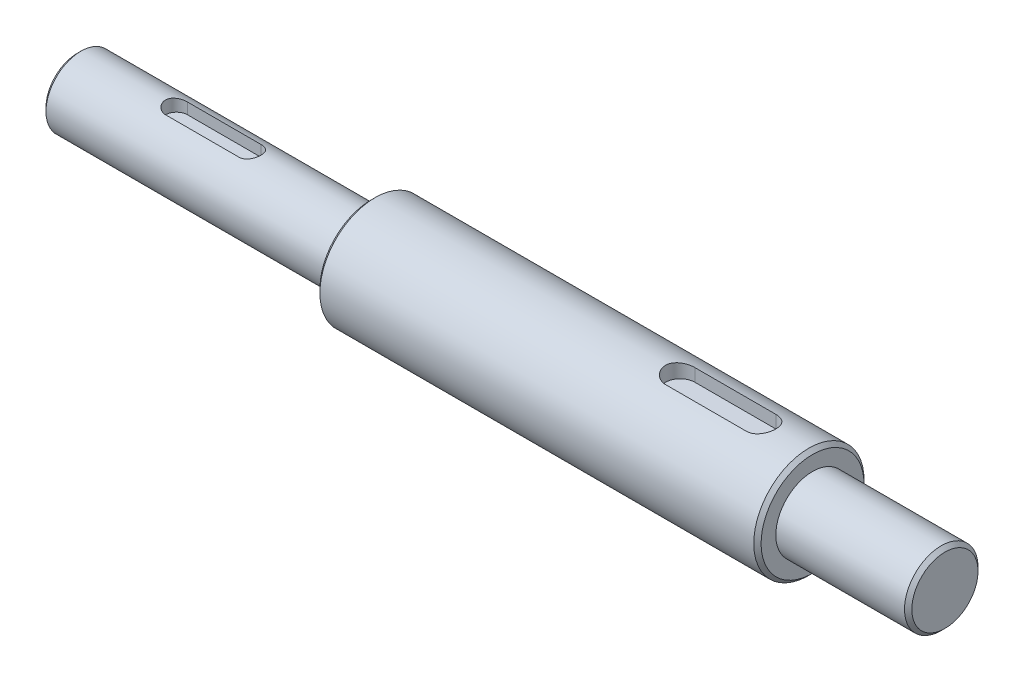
ISO-10303-21;
HEADER;
FILE_DESCRIPTION(('STEP AP214'),'2;1');
FILE_NAME('part.step','',(''),(''),'','','');
FILE_SCHEMA(('AUTOMOTIVE_DESIGN { 1 0 10303 214 1 1 1 1 }'));
ENDSEC;
DATA;
#1=APPLICATION_CONTEXT('core data for automotive mechanical design processes');
#2=APPLICATION_PROTOCOL_DEFINITION('international standard','automotive_design',2000,#1);
#3=PRODUCT_CONTEXT('',#1,'mechanical');
#4=PRODUCT('Part','Part','',(#3));
#5=PRODUCT_RELATED_PRODUCT_CATEGORY('part','',(#4));
#6=PRODUCT_DEFINITION_FORMATION('','',#4);
#7=PRODUCT_DEFINITION_CONTEXT('part definition',#1,'design');
#8=PRODUCT_DEFINITION('design','',#6,#7);
#9=PRODUCT_DEFINITION_SHAPE('','',#8);
#10=(LENGTH_UNIT() NAMED_UNIT(*) SI_UNIT(.MILLI.,.METRE.));
#11=(NAMED_UNIT(*) PLANE_ANGLE_UNIT() SI_UNIT($,.RADIAN.));
#12=(NAMED_UNIT(*) SI_UNIT($,.STERADIAN.) SOLID_ANGLE_UNIT());
#13=UNCERTAINTY_MEASURE_WITH_UNIT(LENGTH_MEASURE(1.E-05),#10,'distance_accuracy_value','');
#14=(GEOMETRIC_REPRESENTATION_CONTEXT(3) GLOBAL_UNCERTAINTY_ASSIGNED_CONTEXT((#13)) GLOBAL_UNIT_ASSIGNED_CONTEXT((#10,
#11,#12)) REPRESENTATION_CONTEXT('',''));
#15=CARTESIAN_POINT('',(0.,0.,0.));
#16=DIRECTION('',(0.,0.,1.));
#17=DIRECTION('',(1.,0.,0.));
#18=AXIS2_PLACEMENT_3D('',#15,#16,#17);
#19=CARTESIAN_POINT('',(236.,2.22044604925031E-13,-1.11022302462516E-13));
#20=DIRECTION('',(1.,0.,0.));
#21=DIRECTION('',(0.,1.00000000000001,0.));
#22=AXIS2_PLACEMENT_3D('',#19,#20,#21);
#23=CYLINDRICAL_SURFACE('',#22,15.);
#24=CARTESIAN_POINT('',(199.,2.22044604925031E-13,-1.11022302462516E-13));
#25=DIRECTION('',(1.,0.,0.));
#26=DIRECTION('',(0.,1.00000000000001,0.));
#27=AXIS2_PLACEMENT_3D('',#24,#25,#26);
#28=CIRCLE('',#27,15.);
#29=CARTESIAN_POINT('',(199.,15.0000000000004,-1.11854969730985E-13));
#30=VERTEX_POINT('',#29);
#31=EDGE_CURVE('E313',#30,#30,#28,.F.);
#32=ORIENTED_EDGE('',*,*,#31,.T.);
#33=EDGE_LOOP('',(#32));
#34=FACE_BOUND('',#33,.T.);
#35=CARTESIAN_POINT('',(81.,2.22044604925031E-13,-1.11022302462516E-13));
#36=DIRECTION('',(-1.,0.,0.));
#37=DIRECTION('',(0.,-1.00000000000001,0.));
#38=AXIS2_PLACEMENT_3D('',#35,#36,#37);
#39=CIRCLE('',#38,15.);
#40=CARTESIAN_POINT('',(81.,-14.9999999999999,-1.10189635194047E-13));
#41=VERTEX_POINT('',#40);
#42=EDGE_CURVE('E309',#41,#41,#39,.F.);
#43=ORIENTED_EDGE('',*,*,#42,.T.);
#44=EDGE_LOOP('',(#43));
#45=FACE_BOUND('',#44,.T.);
#46=CARTESIAN_POINT('',(164.000000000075,14.4568322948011,-4.00000000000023));
#47=CARTESIAN_POINT('',(163.889641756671,14.4568189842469,-4.00001309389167));
#48=CARTESIAN_POINT('',(163.779291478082,14.4580956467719,-3.99543311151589));
#49=CARTESIAN_POINT('',(163.559421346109,14.4631301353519,-3.97718874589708));
#50=CARTESIAN_POINT('',(163.449901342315,14.4668875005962,-3.96352604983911));
#51=CARTESIAN_POINT('',(163.232698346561,14.4767740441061,-3.92725695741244));
#52=CARTESIAN_POINT('',(163.125011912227,14.4828981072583,-3.90466984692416));
#53=CARTESIAN_POINT('',(162.912025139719,14.497323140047,-3.85076543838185));
#54=CARTESIAN_POINT('',(162.80672484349,14.5056241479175,-3.81944798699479));
#55=CARTESIAN_POINT('',(162.495536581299,14.5334412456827,-3.71275643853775));
#56=CARTESIAN_POINT('',(162.294125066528,14.5558829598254,-3.62460332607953));
#57=CARTESIAN_POINT('',(161.908979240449,14.6060171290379,-3.41695780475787));
#58=CARTESIAN_POINT('',(161.725250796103,14.6337113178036,-3.29745504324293));
#59=CARTESIAN_POINT('',(161.376029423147,14.6920016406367,-3.02730320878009));
#60=CARTESIAN_POINT('',(161.211038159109,14.7226489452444,-2.87601544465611));
#61=CARTESIAN_POINT('',(160.908442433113,14.782952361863,-2.54795832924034));
#62=CARTESIAN_POINT('',(160.770842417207,14.8126083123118,-2.37118484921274));
#63=CARTESIAN_POINT('',(160.524827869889,14.8681604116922,-1.99367199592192));
#64=CARTESIAN_POINT('',(160.416916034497,14.8939887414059,-1.79259414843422));
#65=CARTESIAN_POINT('',(160.236627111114,14.9383834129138,-1.37435575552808));
#66=CARTESIAN_POINT('',(160.164242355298,14.9569513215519,-1.15719869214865));
#67=CARTESIAN_POINT('',(160.058690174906,14.9843709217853,-0.718234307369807));
#68=CARTESIAN_POINT('',(160.024662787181,14.993435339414,-0.496647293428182));
#69=CARTESIAN_POINT('',(159.994085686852,15.0015705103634,-0.0507319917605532));
#70=CARTESIAN_POINT('',(159.997530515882,15.0006427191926,0.173595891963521));
#71=CARTESIAN_POINT('',(160.041195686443,14.9890534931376,0.612629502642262));
#72=CARTESIAN_POINT('',(160.080486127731,14.9786381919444,0.827435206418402));
#73=CARTESIAN_POINT('',(160.193225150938,14.9495347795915,1.24728467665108));
#74=CARTESIAN_POINT('',(160.266675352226,14.9308462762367,1.45232797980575));
#75=CARTESIAN_POINT('',(160.446359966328,14.8869312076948,1.84920963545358));
#76=CARTESIAN_POINT('',(160.552913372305,14.8616414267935,2.04089626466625));
#77=CARTESIAN_POINT('',(160.79554276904,14.8072486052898,2.40398441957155));
#78=CARTESIAN_POINT('',(160.931623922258,14.7781448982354,2.57538239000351));
#79=CARTESIAN_POINT('',(161.234327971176,14.7182294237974,2.89854935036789));
#80=CARTESIAN_POINT('',(161.401758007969,14.6873926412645,3.04955722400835));
#81=CARTESIAN_POINT('',(161.760042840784,14.6282716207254,3.32161448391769));
#82=CARTESIAN_POINT('',(161.950904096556,14.5999880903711,3.4426555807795));
#83=CARTESIAN_POINT('',(162.25135328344,14.5618587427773,3.599329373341));
#84=CARTESIAN_POINT('',(162.354288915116,14.5498268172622,3.64754371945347));
#85=CARTESIAN_POINT('',(162.564046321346,14.5275984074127,3.73509417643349));
#86=CARTESIAN_POINT('',(162.670866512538,14.5174011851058,3.77443385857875));
#87=CARTESIAN_POINT('',(162.887519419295,14.4991713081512,3.84386783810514));
#88=CARTESIAN_POINT('',(162.997348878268,14.4911364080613,3.87397173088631));
#89=CARTESIAN_POINT('',(163.2192752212,14.4774747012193,3.92471856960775));
#90=CARTESIAN_POINT('',(163.331371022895,14.4718467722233,3.94536592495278));
#91=CARTESIAN_POINT('',(163.536251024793,14.4639761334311,3.97411378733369));
#92=CARTESIAN_POINT('',(163.628796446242,14.4613012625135,3.98382319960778));
#93=CARTESIAN_POINT('',(163.814225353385,14.4577275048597,3.99676420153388));
#94=CARTESIAN_POINT('',(163.907108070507,14.4568258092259,4.00000603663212));
#95=CARTESIAN_POINT('',(164.000000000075,14.4568322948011,3.99999999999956));
#96=B_SPLINE_CURVE_WITH_KNOTS('',3,(#46,#47,#48,#49,#50,#51,#52,#53,#54,#55,#56,#57,#58,#59,#60,
#61,#62,#63,#64,#65,#66,#67,#68,#69,#70,#71,#72,#73,#74,#75,#76,#77,#78,#79,#80,#81,#82,#83,#84,
#85,#86,#87,#88,#89,#90,#91,#92,#93,#94,#95),.UNSPECIFIED.,.F.,.F.,(4,2,2,2,2,2,2,2,2,2,2,2,2,2,
2,2,2,2,2,2,2,2,2,2,4),(0.,0.330958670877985,0.6618558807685,0.992041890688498,1.32223370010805,
1.9819070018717,2.64179842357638,3.3164963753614,3.99130375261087,4.67691814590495,
5.36238449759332,6.0321566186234,6.701831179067,7.35461236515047,8.00742449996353,
8.66673340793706,9.32615767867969,10.0057598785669,10.6855498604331,11.028107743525,
11.3705275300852,11.7125903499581,12.0544935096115,12.3335333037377,12.6121307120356),.UNSPECIFIED.);
#97=CARTESIAN_POINT('',(164.000000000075,14.4568322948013,-4.00000000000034));
#98=VERTEX_POINT('',#97);
#99=CARTESIAN_POINT('',(164.000000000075,14.4568322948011,3.99999999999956));
#100=VERTEX_POINT('',#99);
#101=EDGE_CURVE('E261',#98,#100,#96,.T.);
#102=ORIENTED_EDGE('',*,*,#101,.F.);
#103=DIRECTION('',(1.,0.,0.));
#104=VECTOR('',#103,1.);
#105=CARTESIAN_POINT('',(236.,14.4568322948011,-4.00000000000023));
#106=LINE('',#105,#104);
#107=CARTESIAN_POINT('',(186.000000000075,14.4568322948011,-4.00000000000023));
#108=VERTEX_POINT('',#107);
#109=EDGE_CURVE('E290',#108,#98,#106,.F.);
#110=ORIENTED_EDGE('',*,*,#109,.F.);
#111=CARTESIAN_POINT('',(186.000000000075,14.4568322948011,4.00000000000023));
#112=CARTESIAN_POINT('',(186.11035824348,14.4568189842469,4.00001309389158));
#113=CARTESIAN_POINT('',(186.220708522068,14.4580956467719,3.99543311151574));
#114=CARTESIAN_POINT('',(186.440578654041,14.4631301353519,3.97718874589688));
#115=CARTESIAN_POINT('',(186.550098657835,14.4668875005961,3.96352604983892));
#116=CARTESIAN_POINT('',(186.767301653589,14.4767740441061,3.92725695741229));
#117=CARTESIAN_POINT('',(186.874988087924,14.4828981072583,3.90466984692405));
#118=CARTESIAN_POINT('',(187.087974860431,14.4973231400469,3.85076543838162));
#119=CARTESIAN_POINT('',(187.193275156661,14.5056241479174,3.81944798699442));
#120=CARTESIAN_POINT('',(187.504463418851,14.5334412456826,3.71275643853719));
#121=CARTESIAN_POINT('',(187.705874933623,14.5558829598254,3.62460332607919));
#122=CARTESIAN_POINT('',(188.091020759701,14.6060171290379,3.41695780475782));
#123=CARTESIAN_POINT('',(188.274749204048,14.6337113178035,3.29745504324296));
#124=CARTESIAN_POINT('',(188.623970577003,14.6920016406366,3.0273032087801));
#125=CARTESIAN_POINT('',(188.788961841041,14.7226489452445,2.87601544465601));
#126=CARTESIAN_POINT('',(189.091557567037,14.782952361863,2.54795832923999));
#127=CARTESIAN_POINT('',(189.229157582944,14.8126083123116,2.37118484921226));
#128=CARTESIAN_POINT('',(189.475172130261,14.868160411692,1.99367199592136));
#129=CARTESIAN_POINT('',(189.583083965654,14.8939887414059,1.79259414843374));
#130=CARTESIAN_POINT('',(189.763372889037,14.9383834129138,1.37435575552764));
#131=CARTESIAN_POINT('',(189.835757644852,14.9569513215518,1.1571986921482));
#132=CARTESIAN_POINT('',(189.941309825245,14.9843709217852,0.718234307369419));
#133=CARTESIAN_POINT('',(189.975337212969,14.9934353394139,0.496647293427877));
#134=CARTESIAN_POINT('',(190.005914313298,15.0015705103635,0.0507319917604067));
#135=CARTESIAN_POINT('',(190.002469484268,15.0006427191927,-0.173595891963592));
#136=CARTESIAN_POINT('',(189.958804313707,14.9890534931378,-0.612629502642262));
#137=CARTESIAN_POINT('',(189.919513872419,14.9786381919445,-0.827435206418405));
#138=CARTESIAN_POINT('',(189.806774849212,14.9495347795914,-1.24728467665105));
#139=CARTESIAN_POINT('',(189.733324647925,14.9308462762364,-1.45232797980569));
#140=CARTESIAN_POINT('',(189.553640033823,14.8869312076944,-1.84920963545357));
#141=CARTESIAN_POINT('',(189.447086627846,14.8616414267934,-2.04089626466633));
#142=CARTESIAN_POINT('',(189.204457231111,14.80724860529,-2.40398441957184));
#143=CARTESIAN_POINT('',(189.068376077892,14.7781448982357,-2.57538239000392));
#144=CARTESIAN_POINT('',(188.765672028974,14.7182294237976,-2.89854935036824));
#145=CARTESIAN_POINT('',(188.598241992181,14.6873926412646,-3.04955722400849));
#146=CARTESIAN_POINT('',(188.239957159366,14.6282716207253,-3.32161448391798));
#147=CARTESIAN_POINT('',(188.049095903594,14.599988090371,-3.44265558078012));
#148=CARTESIAN_POINT('',(187.748646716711,14.5618587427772,-3.59932937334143));
#149=CARTESIAN_POINT('',(187.645711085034,14.5498268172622,-3.64754371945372));
#150=CARTESIAN_POINT('',(187.435953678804,14.5275984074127,-3.73509417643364));
#151=CARTESIAN_POINT('',(187.329133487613,14.5174011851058,-3.77443385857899));
#152=CARTESIAN_POINT('',(187.112480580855,14.4991713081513,-3.84386783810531));
#153=CARTESIAN_POINT('',(187.002651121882,14.4911364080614,-3.87397173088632));
#154=CARTESIAN_POINT('',(186.78072477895,14.4774747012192,-3.92471856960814));
#155=CARTESIAN_POINT('',(186.668628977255,14.471846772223,-3.94536592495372));
#156=CARTESIAN_POINT('',(186.463748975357,14.4639761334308,-3.97411378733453));
#157=CARTESIAN_POINT('',(186.371203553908,14.4613012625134,-3.98382319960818));
#158=CARTESIAN_POINT('',(186.185774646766,14.4577275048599,-3.99676420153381));
#159=CARTESIAN_POINT('',(186.092891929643,14.4568258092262,-4.00000603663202));
#160=CARTESIAN_POINT('',(186.000000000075,14.4568322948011,-4.00000000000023));
#161=B_SPLINE_CURVE_WITH_KNOTS('',3,(#111,#112,#113,#114,#115,#116,#117,#118,#119,#120,#121,
#122,#123,#124,#125,#126,#127,#128,#129,#130,#131,#132,#133,#134,#135,#136,#137,#138,#139,#140,
#141,#142,#143,#144,#145,#146,#147,#148,#149,#150,#151,#152,#153,#154,#155,#156,#157,#158,#159,
#160),.UNSPECIFIED.,.F.,.F.,(4,2,2,2,2,2,2,2,2,2,2,2,2,2,2,2,2,2,2,2,2,2,2,2,4),(0.,
0.330958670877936,0.661855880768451,0.992041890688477,1.32223370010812,1.98190700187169,
2.64179842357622,3.31649637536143,3.99130375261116,4.67691814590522,5.36238449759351,
6.03215661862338,6.70183117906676,7.35461236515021,8.0074244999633,8.66673340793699,
9.32615767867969,10.0057598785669,10.6855498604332,11.0281077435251,11.3705275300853,
11.7125903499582,12.0544935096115,12.3335333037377,12.6121307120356),.UNSPECIFIED.);
#162=CARTESIAN_POINT('',(186.000000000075,14.4568322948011,4.00000000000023));
#163=VERTEX_POINT('',#162);
#164=EDGE_CURVE('E140',#163,#108,#161,.T.);
#165=ORIENTED_EDGE('',*,*,#164,.F.);
#166=DIRECTION('',(1.,0.,0.));
#167=VECTOR('',#166,1.);
#168=CARTESIAN_POINT('',(236.,14.456832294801,3.99999999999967));
#169=LINE('',#168,#167);
#170=EDGE_CURVE('E269',#100,#163,#169,.T.);
#171=ORIENTED_EDGE('',*,*,#170,.F.);
#172=EDGE_LOOP('',(#102,#110,#165,#171));
#173=FACE_BOUND('',#172,.T.);
#174=ADVANCED_FACE('F65',(#34,#45,#173),#23,.T.);
#175=CARTESIAN_POINT('',(-1.11022302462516E-13,2.22044604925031E-13,-1.11022302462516E-13));
#176=DIRECTION('',(-1.,0.,0.));
#177=DIRECTION('',(0.,-1.00000000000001,0.));
#178=AXIS2_PLACEMENT_3D('',#175,#176,#177);
#179=PLANE('',#178);
#180=CARTESIAN_POINT('',(-1.11022302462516E-13,2.22044604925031E-13,-1.11022302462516E-13));
#181=DIRECTION('',(-1.,0.,0.));
#182=DIRECTION('',(0.,-1.00000000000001,0.));
#183=AXIS2_PLACEMENT_3D('',#180,#181,#182);
#184=CIRCLE('',#183,8.50000000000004);
#185=CARTESIAN_POINT('',(-1.10872340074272E-13,-8.4999999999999,-1.1055045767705E-13));
#186=VERTEX_POINT('',#185);
#187=EDGE_CURVE('E297',#186,#186,#184,.T.);
#188=ORIENTED_EDGE('',*,*,#187,.T.);
#189=EDGE_LOOP('',(#188));
#190=FACE_BOUND('',#189,.T.);
#191=CARTESIAN_POINT('',(-1.11022302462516E-13,2.22044604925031E-13,-1.11022302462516E-13));
#192=DIRECTION('',(-1.,0.,0.));
#193=DIRECTION('',(0.,0.,1.00000000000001));
#194=AXIS2_PLACEMENT_3D('',#191,#192,#193);
#195=CIRCLE('',#194,3.4);
#196=CARTESIAN_POINT('',(-1.11022302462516E-13,2.22233342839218E-13,3.39999999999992));
#197=VERTEX_POINT('',#196);
#198=EDGE_CURVE('E213',#197,#197,#195,.T.);
#199=ORIENTED_EDGE('',*,*,#198,.F.);
#200=EDGE_LOOP('',(#199));
#201=FACE_BOUND('',#200,.T.);
#202=ADVANCED_FACE('F332',(#190,#201),#179,.T.);
#203=CARTESIAN_POINT('',(80.,9.50000000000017,1.11022302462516E-13));
#204=DIRECTION('',(-1.,0.,0.));
#205=DIRECTION('',(0.,-1.00000000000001,0.));
#206=AXIS2_PLACEMENT_3D('',#203,#204,#205);
#207=PLANE('',#206);
#208=CARTESIAN_POINT('',(79.9999999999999,2.22044604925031E-13,-1.11022302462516E-13));
#209=DIRECTION('',(-1.,0.,0.));
#210=DIRECTION('',(0.,-1.00000000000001,0.));
#211=AXIS2_PLACEMENT_3D('',#208,#209,#210);
#212=CIRCLE('',#211,13.9999999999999);
#213=CARTESIAN_POINT('',(79.9999999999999,-13.9999999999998,-1.10245146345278E-13));
#214=VERTEX_POINT('',#213);
#215=EDGE_CURVE('E13',#214,#214,#212,.T.);
#216=ORIENTED_EDGE('',*,*,#215,.T.);
#217=EDGE_LOOP('',(#216));
#218=FACE_BOUND('',#217,.T.);
#219=CARTESIAN_POINT('',(79.9999999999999,2.22044604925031E-13,-1.11022302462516E-13));
#220=DIRECTION('',(1.,0.,0.));
#221=DIRECTION('',(0.,1.00000000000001,0.));
#222=AXIS2_PLACEMENT_3D('',#219,#220,#221);
#223=CIRCLE('',#222,9.5);
#224=CARTESIAN_POINT('',(79.9999999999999,9.50000000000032,-1.11549658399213E-13));
#225=VERTEX_POINT('',#224);
#226=EDGE_CURVE('E217',#225,#225,#223,.T.);
#227=ORIENTED_EDGE('',*,*,#226,.T.);
#228=EDGE_LOOP('',(#227));
#229=FACE_BOUND('',#228,.T.);
#230=ADVANCED_FACE('F500',(#218,#229),#207,.T.);
#231=CARTESIAN_POINT('',(236.,2.22044604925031E-13,-1.11022302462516E-13));
#232=DIRECTION('',(1.,0.,0.));
#233=DIRECTION('',(0.,1.00000000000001,0.));
#234=AXIS2_PLACEMENT_3D('',#231,#232,#233);
#235=CYLINDRICAL_SURFACE('',#234,9.5);
#236=CARTESIAN_POINT('',(0.999999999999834,2.22044604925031E-13,-1.11022302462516E-13));
#237=DIRECTION('',(-1.,0.,0.));
#238=DIRECTION('',(0.,-1.00000000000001,0.));
#239=AXIS2_PLACEMENT_3D('',#236,#237,#238);
#240=CIRCLE('',#239,9.5);
#241=CARTESIAN_POINT('',(0.999999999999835,-9.49999999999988,-1.10494946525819E-13));
#242=VERTEX_POINT('',#241);
#243=EDGE_CURVE('E293',#242,#242,#240,.F.);
#244=ORIENTED_EDGE('',*,*,#243,.T.);
#245=EDGE_LOOP('',(#244));
#246=FACE_BOUND('',#245,.T.);
#247=CARTESIAN_POINT('',(47.0000000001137,9.01387818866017,2.99999999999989));
#248=CARTESIAN_POINT('',(47.0821115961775,9.01386597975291,3.00001051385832));
#249=CARTESIAN_POINT('',(47.1642162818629,9.01499989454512,2.99662905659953));
#250=CARTESIAN_POINT('',(47.327794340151,9.01946917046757,2.98316404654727));
#251=CARTESIAN_POINT('',(47.4092678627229,9.0228039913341,2.97308213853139));
#252=CARTESIAN_POINT('',(47.5707866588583,9.03157240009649,2.94633448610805));
#253=CARTESIAN_POINT('',(47.6508352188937,9.03700024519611,2.92968675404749));
#254=CARTESIAN_POINT('',(47.8091467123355,9.04977799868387,2.88997412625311));
#255=CARTESIAN_POINT('',(47.8874095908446,9.0571279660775,2.86690903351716));
#256=CARTESIAN_POINT('',(48.118641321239,9.0817385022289,2.78838156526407));
#257=CARTESIAN_POINT('',(48.2682741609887,9.10157261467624,2.72354999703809));
#258=CARTESIAN_POINT('',(48.554549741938,9.14584733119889,2.57094386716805));
#259=CARTESIAN_POINT('',(48.6911854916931,9.17029039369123,2.48315705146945));
#260=CARTESIAN_POINT('',(48.9524081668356,9.221984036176,2.28383887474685));
#261=CARTESIAN_POINT('',(49.0764774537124,9.24929895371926,2.17164444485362));
#262=CARTESIAN_POINT('',(49.3043874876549,9.30311268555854,1.92811437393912));
#263=CARTESIAN_POINT('',(49.4082247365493,9.32961135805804,1.79677542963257));
#264=CARTESIAN_POINT('',(49.5950383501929,9.37954779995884,1.51492697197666));
#265=CARTESIAN_POINT('',(49.677476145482,9.4029005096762,1.36404405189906));
#266=CARTESIAN_POINT('',(49.8155968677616,9.44315613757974,1.04969762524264));
#267=CARTESIAN_POINT('',(49.8712872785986,9.46006085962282,0.886237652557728));
#268=CARTESIAN_POINT('',(49.9525930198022,9.4850593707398,0.556831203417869));
#269=CARTESIAN_POINT('',(49.9790996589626,9.49341369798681,0.391124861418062));
#270=CARTESIAN_POINT('',(50.004111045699,9.50129109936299,0.0574168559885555));
#271=CARTESIAN_POINT('',(50.0026217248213,9.50081604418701,-0.11058431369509));
#272=CARTESIAN_POINT('',(49.9722655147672,9.49126851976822,-0.437828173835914));
#273=CARTESIAN_POINT('',(49.9443655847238,9.48249971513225,-0.597170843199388));
#274=CARTESIAN_POINT('',(49.8635690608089,9.45772480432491,-0.908782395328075));
#275=CARTESIAN_POINT('',(49.8106711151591,9.4417183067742,-1.06105089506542));
#276=CARTESIAN_POINT('',(49.6807673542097,9.40386197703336,-1.35640803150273));
#277=CARTESIAN_POINT('',(49.6034707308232,9.38194214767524,-1.49935942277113));
#278=CARTESIAN_POINT('',(49.427198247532,9.33456474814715,-1.77055948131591));
#279=CARTESIAN_POINT('',(49.3282170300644,9.30910630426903,-1.89880450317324));
#280=CARTESIAN_POINT('',(49.106446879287,9.25608223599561,-2.14270544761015));
#281=CARTESIAN_POINT('',(48.982826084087,9.22847303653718,-2.25759649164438));
#282=CARTESIAN_POINT('',(48.7177872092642,9.17518254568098,-2.46526929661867));
#283=CARTESIAN_POINT('',(48.5763637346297,9.14950184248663,-2.55804433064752));
#284=CARTESIAN_POINT('',(48.277505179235,9.10274637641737,-2.71978065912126));
#285=CARTESIAN_POINT('',(48.1198965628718,9.08173131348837,-2.78843918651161));
#286=CARTESIAN_POINT('',(47.794613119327,9.04739847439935,-2.89791755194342));
#287=CARTESIAN_POINT('',(47.6269543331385,9.03406877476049,-2.93878053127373));
#288=CARTESIAN_POINT('',(47.3814118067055,9.02162485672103,-2.97664323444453));
#289=CARTESIAN_POINT('',(47.3053703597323,9.01872707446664,-2.985399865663));
#290=CARTESIAN_POINT('',(47.1528991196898,9.01485301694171,-2.99707362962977));
#291=CARTESIAN_POINT('',(47.0764700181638,9.01387406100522,-2.99999890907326));
#292=CARTESIAN_POINT('',(47.0000000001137,9.01387818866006,-3.00000000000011));
#293=B_SPLINE_CURVE_WITH_KNOTS('',3,(#247,#248,#249,#250,#251,#252,#253,#254,#255,#256,#257,
#258,#259,#260,#261,#262,#263,#264,#265,#266,#267,#268,#269,#270,#271,#272,#273,#274,#275,#276,
#277,#278,#279,#280,#281,#282,#283,#284,#285,#286,#287,#288,#289,#290,#291,#292),.UNSPECIFIED.,
.F.,.F.,(4,2,2,2,2,2,2,2,2,2,2,2,2,2,2,2,2,2,2,2,2,2,4),(0.,0.246245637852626,0.492430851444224,
0.737945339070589,0.98346736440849,1.47384684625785,1.96448864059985,2.47064554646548,
2.9768898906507,3.49485361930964,4.01267233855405,4.51419531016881,5.01561202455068,
5.49935290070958,5.98311993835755,6.47288577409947,6.96277275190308,7.47344235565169,
7.98426708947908,8.50129313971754,9.01751487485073,9.24710313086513,9.47637041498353),.UNSPECIFIED.);
#294=CARTESIAN_POINT('',(47.0000000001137,9.01387818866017,2.99999999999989));
#295=VERTEX_POINT('',#294);
#296=CARTESIAN_POINT('',(47.0000000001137,9.01387818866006,-3.00000000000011));
#297=VERTEX_POINT('',#296);
#298=EDGE_CURVE('E221',#295,#297,#293,.T.);
#299=ORIENTED_EDGE('',*,*,#298,.F.);
#300=DIRECTION('',(1.,0.,0.));
#301=VECTOR('',#300,1.);
#302=CARTESIAN_POINT('',(236.,9.01387818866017,2.99999999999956));
#303=LINE('',#302,#301);
#304=CARTESIAN_POINT('',(27.0000000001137,9.01387818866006,3.00000000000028));
#305=VERTEX_POINT('',#304);
#306=EDGE_CURVE('E258',#305,#295,#303,.T.);
#307=ORIENTED_EDGE('',*,*,#306,.F.);
#308=CARTESIAN_POINT('',(27.0000000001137,9.01387818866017,-3.00000000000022));
#309=CARTESIAN_POINT('',(26.9178884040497,9.01386597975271,-3.0000105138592));
#310=CARTESIAN_POINT('',(26.8357837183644,9.01499989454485,-2.99662905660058));
#311=CARTESIAN_POINT('',(26.6722056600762,9.01946917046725,-2.98316404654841));
#312=CARTESIAN_POINT('',(26.5907321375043,9.02280399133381,-2.97308213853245));
#313=CARTESIAN_POINT('',(26.4292133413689,9.0315724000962,-2.94633448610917));
#314=CARTESIAN_POINT('',(26.3491647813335,9.0370002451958,-2.92968675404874));
#315=CARTESIAN_POINT('',(26.1908532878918,9.04977799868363,-2.88997412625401));
#316=CARTESIAN_POINT('',(26.1125904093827,9.05712796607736,-2.86690903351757));
#317=CARTESIAN_POINT('',(25.8813586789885,9.08173850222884,-2.78838156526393));
#318=CARTESIAN_POINT('',(25.7317258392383,9.10157261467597,-2.72354999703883));
#319=CARTESIAN_POINT('',(25.4454502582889,9.14584733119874,-2.57094386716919));
#320=CARTESIAN_POINT('',(25.3088145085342,9.17029039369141,-2.4831570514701));
#321=CARTESIAN_POINT('',(25.0475918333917,9.22198403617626,-2.28383887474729));
#322=CARTESIAN_POINT('',(24.9235225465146,9.24929895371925,-2.17164444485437));
#323=CARTESIAN_POINT('',(24.6956125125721,9.30311268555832,-1.92811437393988));
#324=CARTESIAN_POINT('',(24.591775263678,9.32961135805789,-1.79677542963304));
#325=CARTESIAN_POINT('',(24.4049616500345,9.37954779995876,-1.51492697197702));
#326=CARTESIAN_POINT('',(24.3225238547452,9.40290050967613,-1.36404405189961));
#327=CARTESIAN_POINT('',(24.1844031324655,9.4431561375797,-1.04969762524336));
#328=CARTESIAN_POINT('',(24.1287127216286,9.4600608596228,-0.886237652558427));
#329=CARTESIAN_POINT('',(24.0474069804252,9.48505937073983,-0.556831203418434));
#330=CARTESIAN_POINT('',(24.0209003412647,9.49341369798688,-0.391124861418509));
#331=CARTESIAN_POINT('',(23.9958889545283,9.50129109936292,-0.057416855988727));
#332=CARTESIAN_POINT('',(23.9973782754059,9.50081604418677,0.110584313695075));
#333=CARTESIAN_POINT('',(24.0277344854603,9.49126851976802,0.437828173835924));
#334=CARTESIAN_POINT('',(24.0556344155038,9.48249971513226,0.597170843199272));
#335=CARTESIAN_POINT('',(24.1364309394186,9.4577248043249,0.908782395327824));
#336=CARTESIAN_POINT('',(24.1893288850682,9.44171830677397,1.06105089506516));
#337=CARTESIAN_POINT('',(24.3192326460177,9.40386197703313,1.35640803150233));
#338=CARTESIAN_POINT('',(24.3965292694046,9.38194214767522,1.49935942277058));
#339=CARTESIAN_POINT('',(24.5728017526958,9.33456474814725,1.77055948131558));
#340=CARTESIAN_POINT('',(24.6717829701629,9.30910630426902,1.89880450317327));
#341=CARTESIAN_POINT('',(24.8935531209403,9.25608223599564,2.14270544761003));
#342=CARTESIAN_POINT('',(25.0171739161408,9.22847303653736,2.25759649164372));
#343=CARTESIAN_POINT('',(25.2822127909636,9.17518254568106,2.46526929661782));
#344=CARTESIAN_POINT('',(25.4236362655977,9.14950184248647,2.55804433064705));
#345=CARTESIAN_POINT('',(25.7224948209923,9.1027463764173,2.71978065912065));
#346=CARTESIAN_POINT('',(25.8801034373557,9.08173131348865,2.78843918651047));
#347=CARTESIAN_POINT('',(26.2053868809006,9.04739847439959,2.89791755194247));
#348=CARTESIAN_POINT('',(26.3730456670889,9.03406877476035,2.9387805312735));
#349=CARTESIAN_POINT('',(26.6185881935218,9.02162485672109,2.97664323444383));
#350=CARTESIAN_POINT('',(26.6946296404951,9.01872707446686,2.98539986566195));
#351=CARTESIAN_POINT('',(26.8471008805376,9.01485301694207,2.99707362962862));
#352=CARTESIAN_POINT('',(26.9235299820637,9.01387406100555,2.99999890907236));
#353=CARTESIAN_POINT('',(27.0000000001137,9.01387818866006,3.00000000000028));
#354=B_SPLINE_CURVE_WITH_KNOTS('',3,(#308,#309,#310,#311,#312,#313,#314,#315,#316,#317,#318,
#319,#320,#321,#322,#323,#324,#325,#326,#327,#328,#329,#330,#331,#332,#333,#334,#335,#336,#337,
#338,#339,#340,#341,#342,#343,#344,#345,#346,#347,#348,#349,#350,#351,#352,#353),.UNSPECIFIED.,
.F.,.F.,(4,2,2,2,2,2,2,2,2,2,2,2,2,2,2,2,2,2,2,2,2,2,4),(0.,0.246245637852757,0.49243085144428,
0.737945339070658,0.983467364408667,1.47384684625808,1.96448864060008,2.47064554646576,
2.97688989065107,3.49485361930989,4.01267233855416,4.51419531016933,5.01561202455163,
5.49935290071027,5.983119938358,6.47288577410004,6.96277275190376,7.47344235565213,
7.9842670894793,8.50129313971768,9.01751487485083,9.24710313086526,9.47637041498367),.UNSPECIFIED.);
#355=CARTESIAN_POINT('',(27.0000000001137,9.01387818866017,-3.00000000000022));
#356=VERTEX_POINT('',#355);
#357=EDGE_CURVE('E253',#356,#305,#354,.T.);
#358=ORIENTED_EDGE('',*,*,#357,.F.);
#359=DIRECTION('',(1.,0.,0.));
#360=VECTOR('',#359,1.);
#361=CARTESIAN_POINT('',(236.,9.01387818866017,-3.00000000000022));
#362=LINE('',#361,#360);
#363=EDGE_CURVE('E229',#297,#356,#362,.F.);
#364=ORIENTED_EDGE('',*,*,#363,.F.);
#365=EDGE_LOOP('',(#299,#307,#358,#364));
#366=FACE_BOUND('',#365,.T.);
#367=ORIENTED_EDGE('',*,*,#226,.F.);
#368=EDGE_LOOP('',(#367));
#369=FACE_BOUND('',#368,.T.);
#370=ADVANCED_FACE('F231',(#246,#366,#369),#235,.T.);
#371=CARTESIAN_POINT('',(-1.11022302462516E-13,2.22044604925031E-13,-1.11022302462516E-13));
#372=DIRECTION('',(-1.,0.,0.));
#373=DIRECTION('',(0.,0.,1.00000000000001));
#374=AXIS2_PLACEMENT_3D('',#371,#372,#373);
#375=CYLINDRICAL_SURFACE('',#374,3.4);
#376=CARTESIAN_POINT('',(18.7499999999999,2.22044604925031E-13,-1.11022302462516E-13));
#377=DIRECTION('',(-1.,0.,0.));
#378=DIRECTION('',(0.,0.,1.00000000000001));
#379=AXIS2_PLACEMENT_3D('',#376,#377,#378);
#380=CIRCLE('',#379,3.4);
#381=CARTESIAN_POINT('',(18.7499999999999,2.22233342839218E-13,3.39999999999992));
#382=VERTEX_POINT('',#381);
#383=EDGE_CURVE('E199',#382,#382,#380,.T.);
#384=ORIENTED_EDGE('',*,*,#383,.F.);
#385=EDGE_LOOP('',(#384));
#386=FACE_BOUND('',#385,.T.);
#387=ORIENTED_EDGE('',*,*,#198,.T.);
#388=EDGE_LOOP('',(#387));
#389=FACE_BOUND('',#388,.T.);
#390=ADVANCED_FACE('F482',(#386,#389),#375,.F.);
#391=CARTESIAN_POINT('',(18.7499999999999,2.22044604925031E-13,-1.11022302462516E-13));
#392=DIRECTION('',(-1.,0.,0.));
#393=DIRECTION('',(0.,0.,1.00000000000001));
#394=AXIS2_PLACEMENT_3D('',#391,#392,#393);
#395=CONICAL_SURFACE('',#394,3.4,1.02974425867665);
#396=CARTESIAN_POINT('',(20.7929261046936,2.22044604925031E-13,-1.11022302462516E-13));
#397=VERTEX_POINT('',#396);
#398=VERTEX_LOOP('',#397);
#399=FACE_BOUND('',#398,.T.);
#400=ORIENTED_EDGE('',*,*,#383,.T.);
#401=EDGE_LOOP('',(#400));
#402=FACE_BOUND('',#401,.T.);
#403=ADVANCED_FACE('F251',(#399,#402),#395,.F.);
#404=CARTESIAN_POINT('',(27.0000000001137,6.00000000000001,-5.55111512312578E-13));
#405=DIRECTION('',(0.,1.00000000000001,0.));
#406=DIRECTION('',(-1.,0.,0.));
#407=AXIS2_PLACEMENT_3D('',#404,#405,#406);
#408=CYLINDRICAL_SURFACE('',#407,3.);
#409=DIRECTION('',(0.,1.00000000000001,0.));
#410=VECTOR('',#409,1.);
#411=CARTESIAN_POINT('',(27.0000000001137,6.00000000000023,-3.00000000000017));
#412=LINE('',#411,#410);
#413=CARTESIAN_POINT('',(27.0000000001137,6.00000000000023,-3.00000000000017));
#414=VERTEX_POINT('',#413);
#415=EDGE_CURVE('E195',#414,#356,#412,.T.);
#416=ORIENTED_EDGE('',*,*,#415,.T.);
#417=ORIENTED_EDGE('',*,*,#357,.T.);
#418=DIRECTION('',(0.,1.00000000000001,0.));
#419=VECTOR('',#418,1.);
#420=CARTESIAN_POINT('',(27.0000000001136,6.00000000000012,3.00000000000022));
#421=LINE('',#420,#419);
#422=CARTESIAN_POINT('',(27.0000000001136,6.00000000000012,3.00000000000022));
#423=VERTEX_POINT('',#422);
#424=EDGE_CURVE('E89',#423,#305,#421,.T.);
#425=ORIENTED_EDGE('',*,*,#424,.F.);
#426=CARTESIAN_POINT('',(27.0000000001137,6.00000000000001,-5.55111512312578E-13));
#427=DIRECTION('',(0.,1.00000000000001,0.));
#428=DIRECTION('',(-1.,0.,0.));
#429=AXIS2_PLACEMENT_3D('',#426,#427,#428);
#430=CIRCLE('',#429,3.);
#431=EDGE_CURVE('E173',#414,#423,#430,.T.);
#432=ORIENTED_EDGE('',*,*,#431,.F.);
#433=EDGE_LOOP('',(#416,#417,#425,#432));
#434=FACE_BOUND('',#433,.T.);
#435=ADVANCED_FACE('F247',(#434),#408,.F.);
#436=CARTESIAN_POINT('',(47.0000000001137,6.00000000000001,-3.));
#437=DIRECTION('',(0.,0.,-1.00000000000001));
#438=DIRECTION('',(-1.,0.,0.));
#439=AXIS2_PLACEMENT_3D('',#436,#437,#438);
#440=PLANE('',#439);
#441=ORIENTED_EDGE('',*,*,#363,.T.);
#442=ORIENTED_EDGE('',*,*,#415,.F.);
#443=DIRECTION('',(-1.,0.,0.));
#444=VECTOR('',#443,1.);
#445=CARTESIAN_POINT('',(47.0000000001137,6.00000000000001,-3.));
#446=LINE('',#445,#444);
#447=CARTESIAN_POINT('',(47.0000000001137,6.00000000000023,-3.00000000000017));
#448=VERTEX_POINT('',#447);
#449=EDGE_CURVE('E191',#448,#414,#446,.T.);
#450=ORIENTED_EDGE('',*,*,#449,.F.);
#451=DIRECTION('',(0.,1.00000000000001,0.));
#452=VECTOR('',#451,1.);
#453=CARTESIAN_POINT('',(47.0000000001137,6.00000000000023,-3.00000000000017));
#454=LINE('',#453,#452);
#455=EDGE_CURVE('E200',#448,#297,#454,.T.);
#456=ORIENTED_EDGE('',*,*,#455,.T.);
#457=EDGE_LOOP('',(#441,#442,#450,#456));
#458=FACE_BOUND('',#457,.T.);
#459=ADVANCED_FACE('F241',(#458),#440,.F.);
#460=CARTESIAN_POINT('',(47.0000000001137,6.00000000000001,-5.55111512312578E-13));
#461=DIRECTION('',(0.,1.00000000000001,0.));
#462=DIRECTION('',(-1.,0.,0.));
#463=AXIS2_PLACEMENT_3D('',#460,#461,#462);
#464=CYLINDRICAL_SURFACE('',#463,3.);
#465=DIRECTION('',(0.,1.00000000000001,0.));
#466=VECTOR('',#465,1.);
#467=CARTESIAN_POINT('',(47.0000000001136,6.00000000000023,3.));
#468=LINE('',#467,#466);
#469=CARTESIAN_POINT('',(47.0000000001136,6.00000000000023,3.));
#470=VERTEX_POINT('',#469);
#471=EDGE_CURVE('E204',#470,#295,#468,.T.);
#472=ORIENTED_EDGE('',*,*,#471,.T.);
#473=ORIENTED_EDGE('',*,*,#298,.T.);
#474=ORIENTED_EDGE('',*,*,#455,.F.);
#475=CARTESIAN_POINT('',(47.0000000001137,6.00000000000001,-5.55111512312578E-13));
#476=DIRECTION('',(0.,1.00000000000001,0.));
#477=DIRECTION('',(-1.,0.,0.));
#478=AXIS2_PLACEMENT_3D('',#475,#476,#477);
#479=CIRCLE('',#478,3.);
#480=EDGE_CURVE('E187',#470,#448,#479,.T.);
#481=ORIENTED_EDGE('',*,*,#480,.F.);
#482=EDGE_LOOP('',(#472,#473,#474,#481));
#483=FACE_BOUND('',#482,.T.);
#484=ADVANCED_FACE('F235',(#483),#464,.F.);
#485=CARTESIAN_POINT('',(27.0000000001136,6.00000000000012,3.00000000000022));
#486=DIRECTION('',(0.,0.,1.00000000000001));
#487=DIRECTION('',(1.,0.,0.));
#488=AXIS2_PLACEMENT_3D('',#485,#486,#487);
#489=PLANE('',#488);
#490=ORIENTED_EDGE('',*,*,#306,.T.);
#491=ORIENTED_EDGE('',*,*,#471,.F.);
#492=DIRECTION('',(1.,0.,0.));
#493=VECTOR('',#492,1.);
#494=CARTESIAN_POINT('',(27.0000000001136,6.00000000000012,3.00000000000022));
#495=LINE('',#494,#493);
#496=EDGE_CURVE('E183',#423,#470,#495,.T.);
#497=ORIENTED_EDGE('',*,*,#496,.F.);
#498=ORIENTED_EDGE('',*,*,#424,.T.);
#499=EDGE_LOOP('',(#490,#491,#497,#498));
#500=FACE_BOUND('',#499,.T.);
#501=ADVANCED_FACE('F240',(#500),#489,.F.);
#502=CARTESIAN_POINT('',(27.0000000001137,6.00000000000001,-5.55111512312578E-13));
#503=DIRECTION('',(0.,1.00000000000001,0.));
#504=DIRECTION('',(-1.,0.,0.));
#505=AXIS2_PLACEMENT_3D('',#502,#503,#504);
#506=PLANE('',#505);
#507=ORIENTED_EDGE('',*,*,#431,.T.);
#508=ORIENTED_EDGE('',*,*,#496,.T.);
#509=ORIENTED_EDGE('',*,*,#480,.T.);
#510=ORIENTED_EDGE('',*,*,#449,.T.);
#511=EDGE_LOOP('',(#507,#508,#509,#510));
#512=FACE_BOUND('',#511,.T.);
#513=ADVANCED_FACE('F246',(#512),#506,.T.);
#514=CARTESIAN_POINT('',(186.000000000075,11.0000000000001,-3.33066907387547E-13));
#515=DIRECTION('',(0.,1.00000000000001,0.));
#516=DIRECTION('',(-1.,0.,0.));
#517=AXIS2_PLACEMENT_3D('',#514,#515,#516);
#518=CYLINDRICAL_SURFACE('',#517,4.);
#519=DIRECTION('',(0.,1.00000000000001,0.));
#520=VECTOR('',#519,1.);
#521=CARTESIAN_POINT('',(186.000000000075,11.,4.));
#522=LINE('',#521,#520);
#523=CARTESIAN_POINT('',(186.000000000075,11.,4.));
#524=VERTEX_POINT('',#523);
#525=EDGE_CURVE('E170',#524,#163,#522,.T.);
#526=ORIENTED_EDGE('',*,*,#525,.T.);
#527=ORIENTED_EDGE('',*,*,#164,.T.);
#528=DIRECTION('',(0.,1.00000000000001,0.));
#529=VECTOR('',#528,1.);
#530=CARTESIAN_POINT('',(186.000000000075,11.0000000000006,-4.00000000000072));
#531=LINE('',#530,#529);
#532=CARTESIAN_POINT('',(186.000000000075,11.0000000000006,-4.00000000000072));
#533=VERTEX_POINT('',#532);
#534=EDGE_CURVE('E81',#533,#108,#531,.T.);
#535=ORIENTED_EDGE('',*,*,#534,.F.);
#536=CARTESIAN_POINT('',(186.000000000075,11.0000000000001,-3.33066907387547E-13));
#537=DIRECTION('',(0.,1.00000000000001,0.));
#538=DIRECTION('',(-1.,0.,0.));
#539=AXIS2_PLACEMENT_3D('',#536,#537,#538);
#540=CIRCLE('',#539,4.);
#541=EDGE_CURVE('E138',#524,#533,#540,.T.);
#542=ORIENTED_EDGE('',*,*,#541,.F.);
#543=EDGE_LOOP('',(#526,#527,#535,#542));
#544=FACE_BOUND('',#543,.T.);
#545=ADVANCED_FACE('F136',(#544),#518,.F.);
#546=CARTESIAN_POINT('',(164.000000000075,11.,4.));
#547=DIRECTION('',(0.,0.,1.00000000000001));
#548=DIRECTION('',(1.,0.,0.));
#549=AXIS2_PLACEMENT_3D('',#546,#547,#548);
#550=PLANE('',#549);
#551=ORIENTED_EDGE('',*,*,#170,.T.);
#552=ORIENTED_EDGE('',*,*,#525,.F.);
#553=DIRECTION('',(1.,0.,0.));
#554=VECTOR('',#553,1.);
#555=CARTESIAN_POINT('',(164.000000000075,11.,4.));
#556=LINE('',#555,#554);
#557=CARTESIAN_POINT('',(164.000000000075,11.0000000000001,3.99999999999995));
#558=VERTEX_POINT('',#557);
#559=EDGE_CURVE('E144',#558,#524,#556,.T.);
#560=ORIENTED_EDGE('',*,*,#559,.F.);
#561=DIRECTION('',(0.,1.00000000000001,0.));
#562=VECTOR('',#561,1.);
#563=CARTESIAN_POINT('',(164.000000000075,11.0000000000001,3.99999999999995));
#564=LINE('',#563,#562);
#565=EDGE_CURVE('E174',#558,#100,#564,.T.);
#566=ORIENTED_EDGE('',*,*,#565,.T.);
#567=EDGE_LOOP('',(#551,#552,#560,#566));
#568=FACE_BOUND('',#567,.T.);
#569=ADVANCED_FACE('F278',(#568),#550,.F.);
#570=CARTESIAN_POINT('',(164.000000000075,11.0000000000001,1.66533453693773E-13));
#571=DIRECTION('',(0.,1.00000000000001,0.));
#572=DIRECTION('',(-1.,0.,0.));
#573=AXIS2_PLACEMENT_3D('',#570,#571,#572);
#574=CYLINDRICAL_SURFACE('',#573,4.);
#575=DIRECTION('',(0.,1.00000000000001,0.));
#576=VECTOR('',#575,1.);
#577=CARTESIAN_POINT('',(164.000000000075,11.0000000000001,-3.99999999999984));
#578=LINE('',#577,#576);
#579=CARTESIAN_POINT('',(164.000000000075,11.0000000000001,-3.99999999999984));
#580=VERTEX_POINT('',#579);
#581=EDGE_CURVE('E143',#580,#98,#578,.T.);
#582=ORIENTED_EDGE('',*,*,#581,.T.);
#583=ORIENTED_EDGE('',*,*,#101,.T.);
#584=ORIENTED_EDGE('',*,*,#565,.F.);
#585=CARTESIAN_POINT('',(164.000000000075,11.0000000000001,1.66533453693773E-13));
#586=DIRECTION('',(0.,1.00000000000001,0.));
#587=DIRECTION('',(-1.,0.,0.));
#588=AXIS2_PLACEMENT_3D('',#585,#586,#587);
#589=CIRCLE('',#588,4.);
#590=EDGE_CURVE('E154',#580,#558,#589,.T.);
#591=ORIENTED_EDGE('',*,*,#590,.F.);
#592=EDGE_LOOP('',(#582,#583,#584,#591));
#593=FACE_BOUND('',#592,.T.);
#594=ADVANCED_FACE('F273',(#593),#574,.F.);
#595=CARTESIAN_POINT('',(186.000000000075,11.0000000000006,-4.00000000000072));
#596=DIRECTION('',(0.,0.,-1.00000000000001));
#597=DIRECTION('',(-1.,0.,0.));
#598=AXIS2_PLACEMENT_3D('',#595,#596,#597);
#599=PLANE('',#598);
#600=ORIENTED_EDGE('',*,*,#109,.T.);
#601=ORIENTED_EDGE('',*,*,#581,.F.);
#602=DIRECTION('',(-1.,0.,0.));
#603=VECTOR('',#602,1.);
#604=CARTESIAN_POINT('',(186.000000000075,11.0000000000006,-4.00000000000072));
#605=LINE('',#604,#603);
#606=EDGE_CURVE('E147',#533,#580,#605,.T.);
#607=ORIENTED_EDGE('',*,*,#606,.F.);
#608=ORIENTED_EDGE('',*,*,#534,.T.);
#609=EDGE_LOOP('',(#600,#601,#607,#608));
#610=FACE_BOUND('',#609,.T.);
#611=ADVANCED_FACE('F148',(#610),#599,.F.);
#612=CARTESIAN_POINT('',(186.000000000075,11.0000000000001,-3.33066907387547E-13));
#613=DIRECTION('',(0.,1.00000000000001,0.));
#614=DIRECTION('',(-1.,0.,0.));
#615=AXIS2_PLACEMENT_3D('',#612,#613,#614);
#616=PLANE('',#615);
#617=ORIENTED_EDGE('',*,*,#541,.T.);
#618=ORIENTED_EDGE('',*,*,#606,.T.);
#619=ORIENTED_EDGE('',*,*,#590,.T.);
#620=ORIENTED_EDGE('',*,*,#559,.T.);
#621=EDGE_LOOP('',(#617,#618,#619,#620));
#622=FACE_BOUND('',#621,.T.);
#623=ADVANCED_FACE('F156',(#622),#616,.T.);
#624=CARTESIAN_POINT('',(200.,2.22044604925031E-13,-1.11022302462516E-13));
#625=DIRECTION('',(1.,0.,0.));
#626=DIRECTION('',(0.,1.00000000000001,0.));
#627=AXIS2_PLACEMENT_3D('',#624,#625,#626);
#628=PLANE('',#627);
#629=CARTESIAN_POINT('',(200.,2.22044604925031E-13,-1.11022302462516E-13));
#630=DIRECTION('',(1.,0.,0.));
#631=DIRECTION('',(0.,1.00000000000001,0.));
#632=AXIS2_PLACEMENT_3D('',#629,#630,#631);
#633=CIRCLE('',#632,14.);
#634=CARTESIAN_POINT('',(200.,14.0000000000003,-1.11799458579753E-13));
#635=VERTEX_POINT('',#634);
#636=EDGE_CURVE('E74',#635,#635,#633,.T.);
#637=ORIENTED_EDGE('',*,*,#636,.T.);
#638=EDGE_LOOP('',(#637));
#639=FACE_BOUND('',#638,.T.);
#640=CARTESIAN_POINT('',(200.,2.22044604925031E-13,-1.11022302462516E-13));
#641=DIRECTION('',(1.,0.,0.));
#642=DIRECTION('',(0.,1.00000000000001,0.));
#643=AXIS2_PLACEMENT_3D('',#640,#641,#642);
#644=CIRCLE('',#643,10.);
#645=CARTESIAN_POINT('',(200.,10.0000000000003,-1.11577413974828E-13));
#646=VERTEX_POINT('',#645);
#647=EDGE_CURVE('E159',#646,#646,#644,.T.);
#648=ORIENTED_EDGE('',*,*,#647,.F.);
#649=EDGE_LOOP('',(#648));
#650=FACE_BOUND('',#649,.T.);
#651=ADVANCED_FACE('F321',(#639,#650),#628,.T.);
#652=CARTESIAN_POINT('',(200.,2.22044604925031E-13,-1.11022302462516E-13));
#653=DIRECTION('',(1.,0.,0.));
#654=DIRECTION('',(0.,1.00000000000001,0.));
#655=AXIS2_PLACEMENT_3D('',#652,#653,#654);
#656=CYLINDRICAL_SURFACE('',#655,10.);
#657=CARTESIAN_POINT('',(235.,2.22044604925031E-13,-1.11022302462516E-13));
#658=DIRECTION('',(1.,0.,0.));
#659=DIRECTION('',(0.,1.00000000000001,0.));
#660=AXIS2_PLACEMENT_3D('',#657,#658,#659);
#661=CIRCLE('',#660,10.);
#662=CARTESIAN_POINT('',(235.,10.0000000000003,-1.11577413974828E-13));
#663=VERTEX_POINT('',#662);
#664=EDGE_CURVE('E305',#663,#663,#661,.F.);
#665=ORIENTED_EDGE('',*,*,#664,.T.);
#666=EDGE_LOOP('',(#665));
#667=FACE_BOUND('',#666,.T.);
#668=ORIENTED_EDGE('',*,*,#647,.T.);
#669=EDGE_LOOP('',(#668));
#670=FACE_BOUND('',#669,.T.);
#671=ADVANCED_FACE('F363',(#667,#670),#656,.T.);
#672=CARTESIAN_POINT('',(236.,15.0000000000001,1.11022302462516E-13));
#673=DIRECTION('',(1.,0.,0.));
#674=DIRECTION('',(0.,1.00000000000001,0.));
#675=AXIS2_PLACEMENT_3D('',#672,#673,#674);
#676=PLANE('',#675);
#677=CARTESIAN_POINT('',(236.,2.22044604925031E-13,-1.11022302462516E-13));
#678=DIRECTION('',(1.,0.,0.));
#679=DIRECTION('',(0.,1.00000000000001,0.));
#680=AXIS2_PLACEMENT_3D('',#677,#678,#679);
#681=CIRCLE('',#680,8.99999999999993);
#682=CARTESIAN_POINT('',(236.,9.00000000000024,-1.11521902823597E-13));
#683=VERTEX_POINT('',#682);
#684=EDGE_CURVE('E301',#683,#683,#681,.T.);
#685=ORIENTED_EDGE('',*,*,#684,.T.);
#686=EDGE_LOOP('',(#685));
#687=FACE_BOUND('',#686,.T.);
#688=ADVANCED_FACE('F370',(#687),#676,.T.);
#689=CARTESIAN_POINT('',(0.999999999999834,2.22044604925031E-13,-1.11022302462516E-13));
#690=DIRECTION('',(1.,0.,0.));
#691=DIRECTION('',(0.,1.00000000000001,0.));
#692=AXIS2_PLACEMENT_3D('',#689,#690,#691);
#693=CONICAL_SURFACE('',#692,9.5,0.785398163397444);
#694=ORIENTED_EDGE('',*,*,#187,.F.);
#695=EDGE_LOOP('',(#694));
#696=FACE_BOUND('',#695,.T.);
#697=ORIENTED_EDGE('',*,*,#243,.F.);
#698=EDGE_LOOP('',(#697));
#699=FACE_BOUND('',#698,.T.);
#700=ADVANCED_FACE('F378',(#696,#699),#693,.T.);
#701=CARTESIAN_POINT('',(236.,2.22044604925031E-13,-1.11022302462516E-13));
#702=DIRECTION('',(-1.,0.,0.));
#703=DIRECTION('',(0.,-1.00000000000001,0.));
#704=AXIS2_PLACEMENT_3D('',#701,#702,#703);
#705=CONICAL_SURFACE('',#704,8.99999999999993,0.785398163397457);
#706=ORIENTED_EDGE('',*,*,#664,.F.);
#707=EDGE_LOOP('',(#706));
#708=FACE_BOUND('',#707,.T.);
#709=ORIENTED_EDGE('',*,*,#684,.F.);
#710=EDGE_LOOP('',(#709));
#711=FACE_BOUND('',#710,.T.);
#712=ADVANCED_FACE('F327',(#708,#711),#705,.T.);
#713=CARTESIAN_POINT('',(199.,2.22044604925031E-13,-1.11022302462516E-13));
#714=DIRECTION('',(-1.,0.,0.));
#715=DIRECTION('',(0.,-1.00000000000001,0.));
#716=AXIS2_PLACEMENT_3D('',#713,#714,#715);
#717=CONICAL_SURFACE('',#716,15.,0.785398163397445);
#718=ORIENTED_EDGE('',*,*,#636,.F.);
#719=EDGE_LOOP('',(#718));
#720=FACE_BOUND('',#719,.T.);
#721=ORIENTED_EDGE('',*,*,#31,.F.);
#722=EDGE_LOOP('',(#721));
#723=FACE_BOUND('',#722,.T.);
#724=ADVANCED_FACE('F324',(#720,#723),#717,.T.);
#725=CARTESIAN_POINT('',(81.,2.22044604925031E-13,-1.11022302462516E-13));
#726=DIRECTION('',(1.,0.,0.));
#727=DIRECTION('',(0.,1.00000000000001,0.));
#728=AXIS2_PLACEMENT_3D('',#725,#726,#727);
#729=CONICAL_SURFACE('',#728,15.,0.785398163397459);
#730=ORIENTED_EDGE('',*,*,#215,.F.);
#731=EDGE_LOOP('',(#730));
#732=FACE_BOUND('',#731,.T.);
#733=ORIENTED_EDGE('',*,*,#42,.F.);
#734=EDGE_LOOP('',(#733));
#735=FACE_BOUND('',#734,.T.);
#736=ADVANCED_FACE('F67',(#732,#735),#729,.T.);
#737=CLOSED_SHELL('',(#174,#202,#230,#370,#390,#403,#435,#459,#484,#501,#513,#545,#569,#594,
#611,#623,#651,#671,#688,#700,#712,#724,#736));
#738=MANIFOLD_SOLID_BREP('B2',#737);
#739=ADVANCED_BREP_SHAPE_REPRESENTATION('',(#18,#738),#14);
#740=SHAPE_DEFINITION_REPRESENTATION(#9,#739);
ENDSEC;
END-ISO-10303-21;
